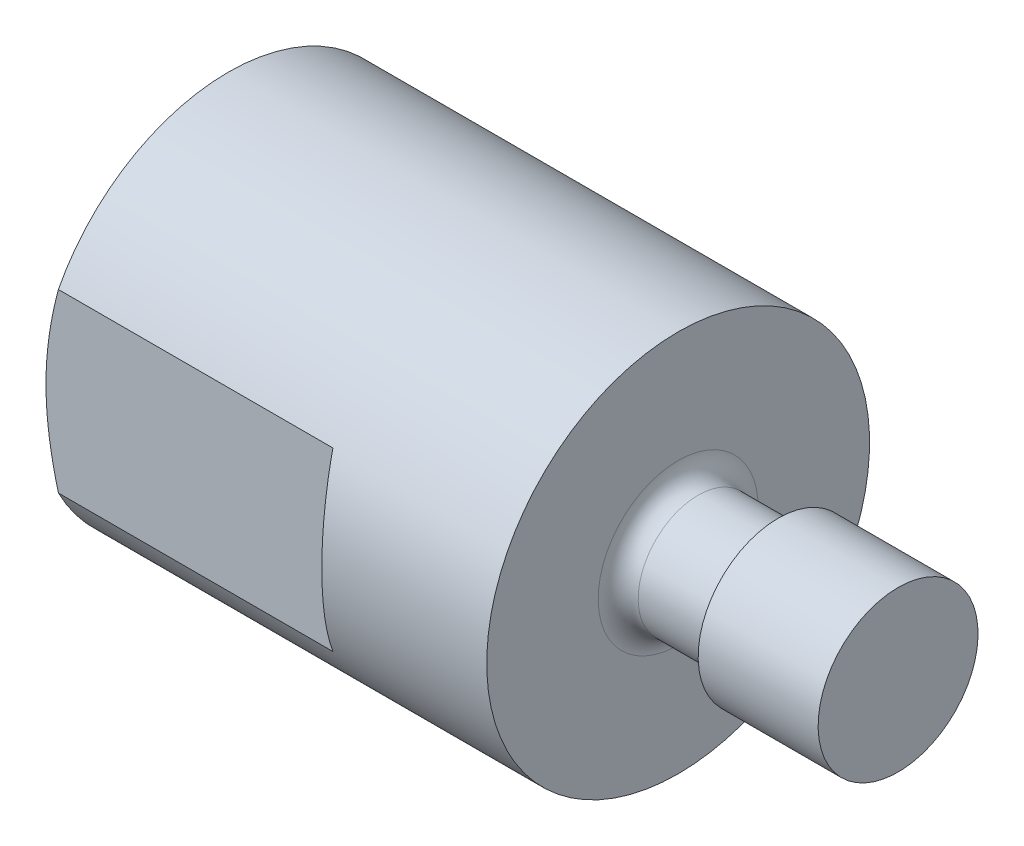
ISO-10303-21;
HEADER;
FILE_DESCRIPTION(('STEP AP214'),'2;1');
FILE_NAME('part.step','',(''),(''),'','','');
FILE_SCHEMA(('AUTOMOTIVE_DESIGN { 1 0 10303 214 1 1 1 1 }'));
ENDSEC;
DATA;
#1=APPLICATION_CONTEXT('core data for automotive mechanical design processes');
#2=APPLICATION_PROTOCOL_DEFINITION('international standard','automotive_design',2000,#1);
#3=PRODUCT_CONTEXT('',#1,'mechanical');
#4=PRODUCT('Part','Part','',(#3));
#5=PRODUCT_RELATED_PRODUCT_CATEGORY('part','',(#4));
#6=PRODUCT_DEFINITION_FORMATION('','',#4);
#7=PRODUCT_DEFINITION_CONTEXT('part definition',#1,'design');
#8=PRODUCT_DEFINITION('design','',#6,#7);
#9=PRODUCT_DEFINITION_SHAPE('','',#8);
#10=(LENGTH_UNIT() NAMED_UNIT(*) SI_UNIT(.MILLI.,.METRE.));
#11=(NAMED_UNIT(*) PLANE_ANGLE_UNIT() SI_UNIT($,.RADIAN.));
#12=(NAMED_UNIT(*) SI_UNIT($,.STERADIAN.) SOLID_ANGLE_UNIT());
#13=UNCERTAINTY_MEASURE_WITH_UNIT(LENGTH_MEASURE(1.E-05),#10,'distance_accuracy_value','');
#14=(GEOMETRIC_REPRESENTATION_CONTEXT(3) GLOBAL_UNCERTAINTY_ASSIGNED_CONTEXT((#13)) GLOBAL_UNIT_ASSIGNED_CONTEXT((#10,
#11,#12)) REPRESENTATION_CONTEXT('',''));
#15=CARTESIAN_POINT('',(0.,0.,0.));
#16=DIRECTION('',(0.,0.,1.));
#17=DIRECTION('',(1.,0.,0.));
#18=AXIS2_PLACEMENT_3D('',#15,#16,#17);
#19=CARTESIAN_POINT('',(1.,0.,0.));
#20=DIRECTION('',(1.,0.,0.));
#21=DIRECTION('',(0.,1.,0.));
#22=AXIS2_PLACEMENT_3D('',#19,#20,#21);
#23=CONICAL_SURFACE('',#22,9.575,1.0471975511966);
#24=CARTESIAN_POINT('',(0.,0.,0.));
#25=DIRECTION('',(1.,0.,0.));
#26=DIRECTION('',(0.,1.,0.));
#27=AXIS2_PLACEMENT_3D('',#24,#25,#26);
#28=CIRCLE('',#27,7.84294919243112);
#29=CARTESIAN_POINT('',(0.,7.84294919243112,0.));
#30=VERTEX_POINT('',#29);
#31=EDGE_CURVE('E143',#30,#30,#28,.T.);
#32=ORIENTED_EDGE('',*,*,#31,.T.);
#33=EDGE_LOOP('',(#32));
#34=FACE_BOUND('',#33,.T.);
#35=CARTESIAN_POINT('',(1.,0.,0.));
#36=DIRECTION('',(1.,0.,0.));
#37=DIRECTION('',(0.,1.,0.));
#38=AXIS2_PLACEMENT_3D('',#35,#36,#37);
#39=CIRCLE('',#38,9.575);
#40=CARTESIAN_POINT('',(1.,4.40801826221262,-8.5));
#41=VERTEX_POINT('',#40);
#42=CARTESIAN_POINT('',(1.00000000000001,4.40801826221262,8.5));
#43=VERTEX_POINT('',#42);
#44=EDGE_CURVE('E142',#41,#43,#39,.T.);
#45=ORIENTED_EDGE('',*,*,#44,.F.);
#46=CARTESIAN_POINT('',(4.36089259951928,-12.8372156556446,-8.5));
#47=CARTESIAN_POINT('',(4.27139653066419,-12.6512992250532,-8.5));
#48=CARTESIAN_POINT('',(4.18237819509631,-12.4651529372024,-8.5));
#49=CARTESIAN_POINT('',(4.00540707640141,-12.0923520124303,-8.5));
#50=CARTESIAN_POINT('',(3.91745430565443,-11.9056973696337,-8.5));
#51=CARTESIAN_POINT('',(3.65533262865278,-11.3448403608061,-8.5));
#52=CARTESIAN_POINT('',(3.48293111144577,-10.9698086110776,-8.5));
#53=CARTESIAN_POINT('',(3.14296570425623,-10.2148534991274,-8.5));
#54=CARTESIAN_POINT('',(2.97543689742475,-9.8349142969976,-8.5));
#55=CARTESIAN_POINT('',(2.64783348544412,-9.07184719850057,-8.5));
#56=CARTESIAN_POINT('',(2.48775847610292,-8.68871947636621,-8.5));
#57=CARTESIAN_POINT('',(2.17549814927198,-7.91475078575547,-8.5));
#58=CARTESIAN_POINT('',(2.02340850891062,-7.52387099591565,-8.5));
#59=CARTESIAN_POINT('',(1.73159150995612,-6.73743923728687,-8.5));
#60=CARTESIAN_POINT('',(1.59186554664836,-6.34188674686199,-8.5));
#61=CARTESIAN_POINT('',(1.32866203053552,-5.546349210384,-8.5));
#62=CARTESIAN_POINT('',(1.2051483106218,-5.14637626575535,-8.5));
#63=CARTESIAN_POINT('',(0.978492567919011,-4.3407706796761,-8.5));
#64=CARTESIAN_POINT('',(0.875343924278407,-3.93513992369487,-8.5));
#65=CARTESIAN_POINT('',(0.694530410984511,-3.11780575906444,-8.5));
#66=CARTESIAN_POINT('',(0.616881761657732,-2.70609865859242,-8.5));
#67=CARTESIAN_POINT('',(0.523519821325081,-2.08507081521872,-8.5));
#68=CARTESIAN_POINT('',(0.496249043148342,-1.8774574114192,-8.5));
#69=CARTESIAN_POINT('',(0.449950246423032,-1.46132002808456,-8.5));
#70=CARTESIAN_POINT('',(0.430921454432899,-1.25279613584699,-8.5));
#71=CARTESIAN_POINT('',(0.401610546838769,-0.836338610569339,-8.5));
#72=CARTESIAN_POINT('',(0.391278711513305,-0.628408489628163,-8.5));
#73=CARTESIAN_POINT('',(0.379412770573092,-0.212298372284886,-8.5));
#74=CARTESIAN_POINT('',(0.377878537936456,-0.00411837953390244,-8.5));
#75=CARTESIAN_POINT('',(0.383643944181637,0.412065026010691,-8.5));
#76=CARTESIAN_POINT('',(0.390941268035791,0.620068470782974,-8.5));
#77=CARTESIAN_POINT('',(0.414194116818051,1.03559395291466,-8.5));
#78=CARTESIAN_POINT('',(0.430150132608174,1.24311596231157,-8.5));
#79=CARTESIAN_POINT('',(0.479548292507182,1.75178817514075,-8.5));
#80=CARTESIAN_POINT('',(0.517645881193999,2.05249455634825,-8.5));
#81=CARTESIAN_POINT('',(0.609856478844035,2.65142977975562,-8.5));
#82=CARTESIAN_POINT('',(0.663972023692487,2.94965822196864,-8.5));
#83=CARTESIAN_POINT('',(0.847616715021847,3.84120788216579,-8.5));
#84=CARTESIAN_POINT('',(0.998315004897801,4.43021264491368,-8.5));
#85=CARTESIAN_POINT('',(1.2566186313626,5.3109066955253,-8.5));
#86=CARTESIAN_POINT('',(1.34929645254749,5.60723378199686,-8.5));
#87=CARTESIAN_POINT('',(1.54351203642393,6.19702583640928,-8.5));
#88=CARTESIAN_POINT('',(1.64505057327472,6.49049055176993,-8.5));
#89=CARTESIAN_POINT('',(1.85484115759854,7.07308798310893,-8.5));
#90=CARTESIAN_POINT('',(1.96305147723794,7.36223587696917,-8.5));
#91=CARTESIAN_POINT('',(2.18549130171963,7.93809953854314,-8.5));
#92=CARTESIAN_POINT('',(2.29971876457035,8.22481609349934,-8.5));
#93=CARTESIAN_POINT('',(2.41638555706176,8.51051350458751,-8.5));
#94=B_SPLINE_CURVE_WITH_KNOTS('',3,(#46,#47,#48,#49,#50,#51,#52,#53,#54,#55,#56,#57,#58,#59,#60,
#61,#62,#63,#64,#65,#66,#67,#68,#69,#70,#71,#72,#73,#74,#75,#76,#77,#78,#79,#80,#81,#82,#83,#84,
#85,#86,#87,#88,#89,#90,#91,#92,#93),.UNSPECIFIED.,.F.,.F.,(4,2,2,2,2,2,2,2,2,2,2,2,2,2,2,2,2,2,
2,2,2,2,2,4),(0.,0.619006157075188,1.238019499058,2.47625836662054,3.72189992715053,
4.96747386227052,6.22559022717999,7.48384839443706,8.73925005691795,9.9942429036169,
11.2500325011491,11.8780848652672,12.5060782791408,13.130456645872,13.7548259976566,
14.3790317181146,15.0032728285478,15.9120828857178,16.8210368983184,18.6424926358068,
19.573870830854,20.5053304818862,21.4314616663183,22.3572805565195),.UNSPECIFIED.);
#95=CARTESIAN_POINT('',(1.00000000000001,-4.40801826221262,-8.5));
#96=VERTEX_POINT('',#95);
#97=EDGE_CURVE('E83',#41,#96,#94,.F.);
#98=ORIENTED_EDGE('',*,*,#97,.T.);
#99=CARTESIAN_POINT('',(0.999999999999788,-4.40801826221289,8.5));
#100=VERTEX_POINT('',#99);
#101=EDGE_CURVE('E141',#100,#96,#39,.T.);
#102=ORIENTED_EDGE('',*,*,#101,.F.);
#103=CARTESIAN_POINT('',(4.36089259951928,-12.8372156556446,8.5));
#104=CARTESIAN_POINT('',(4.27139653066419,-12.6512992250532,8.5));
#105=CARTESIAN_POINT('',(4.18237819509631,-12.4651529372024,8.5));
#106=CARTESIAN_POINT('',(4.00540707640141,-12.0923520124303,8.5));
#107=CARTESIAN_POINT('',(3.91745430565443,-11.9056973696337,8.5));
#108=CARTESIAN_POINT('',(3.65533262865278,-11.3448403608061,8.5));
#109=CARTESIAN_POINT('',(3.48293111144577,-10.9698086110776,8.5));
#110=CARTESIAN_POINT('',(3.14296570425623,-10.2148534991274,8.5));
#111=CARTESIAN_POINT('',(2.97543689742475,-9.8349142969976,8.5));
#112=CARTESIAN_POINT('',(2.64783348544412,-9.07184719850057,8.5));
#113=CARTESIAN_POINT('',(2.48775847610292,-8.68871947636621,8.5));
#114=CARTESIAN_POINT('',(2.17549814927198,-7.91475078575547,8.5));
#115=CARTESIAN_POINT('',(2.02340850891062,-7.52387099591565,8.5));
#116=CARTESIAN_POINT('',(1.73159150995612,-6.73743923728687,8.5));
#117=CARTESIAN_POINT('',(1.59186554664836,-6.34188674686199,8.5));
#118=CARTESIAN_POINT('',(1.32866203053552,-5.546349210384,8.5));
#119=CARTESIAN_POINT('',(1.2051483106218,-5.14637626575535,8.5));
#120=CARTESIAN_POINT('',(0.978492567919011,-4.3407706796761,8.5));
#121=CARTESIAN_POINT('',(0.875343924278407,-3.93513992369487,8.5));
#122=CARTESIAN_POINT('',(0.694530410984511,-3.11780575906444,8.5));
#123=CARTESIAN_POINT('',(0.616881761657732,-2.70609865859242,8.5));
#124=CARTESIAN_POINT('',(0.523519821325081,-2.08507081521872,8.5));
#125=CARTESIAN_POINT('',(0.496249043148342,-1.8774574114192,8.5));
#126=CARTESIAN_POINT('',(0.449950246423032,-1.46132002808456,8.5));
#127=CARTESIAN_POINT('',(0.430921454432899,-1.25279613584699,8.5));
#128=CARTESIAN_POINT('',(0.401610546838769,-0.836338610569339,8.5));
#129=CARTESIAN_POINT('',(0.391278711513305,-0.628408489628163,8.5));
#130=CARTESIAN_POINT('',(0.379412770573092,-0.212298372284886,8.5));
#131=CARTESIAN_POINT('',(0.377878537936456,-0.00411837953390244,8.5));
#132=CARTESIAN_POINT('',(0.383643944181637,0.412065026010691,8.5));
#133=CARTESIAN_POINT('',(0.390941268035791,0.620068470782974,8.5));
#134=CARTESIAN_POINT('',(0.414194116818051,1.03559395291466,8.5));
#135=CARTESIAN_POINT('',(0.430150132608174,1.24311596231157,8.5));
#136=CARTESIAN_POINT('',(0.479548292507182,1.75178817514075,8.5));
#137=CARTESIAN_POINT('',(0.517645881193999,2.05249455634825,8.5));
#138=CARTESIAN_POINT('',(0.609856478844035,2.65142977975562,8.5));
#139=CARTESIAN_POINT('',(0.663972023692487,2.94965822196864,8.5));
#140=CARTESIAN_POINT('',(0.847616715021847,3.84120788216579,8.5));
#141=CARTESIAN_POINT('',(0.998315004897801,4.43021264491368,8.5));
#142=CARTESIAN_POINT('',(1.2566186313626,5.3109066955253,8.5));
#143=CARTESIAN_POINT('',(1.34929645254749,5.60723378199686,8.5));
#144=CARTESIAN_POINT('',(1.54351203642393,6.19702583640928,8.5));
#145=CARTESIAN_POINT('',(1.64505057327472,6.49049055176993,8.5));
#146=CARTESIAN_POINT('',(1.85484115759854,7.07308798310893,8.5));
#147=CARTESIAN_POINT('',(1.96305147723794,7.36223587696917,8.5));
#148=CARTESIAN_POINT('',(2.18549130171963,7.93809953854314,8.5));
#149=CARTESIAN_POINT('',(2.29971876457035,8.22481609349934,8.5));
#150=CARTESIAN_POINT('',(2.41638555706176,8.51051350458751,8.5));
#151=B_SPLINE_CURVE_WITH_KNOTS('',3,(#103,#104,#105,#106,#107,#108,#109,#110,#111,#112,#113,
#114,#115,#116,#117,#118,#119,#120,#121,#122,#123,#124,#125,#126,#127,#128,#129,#130,#131,#132,
#133,#134,#135,#136,#137,#138,#139,#140,#141,#142,#143,#144,#145,#146,#147,#148,#149,#150),
.UNSPECIFIED.,.F.,.F.,(4,2,2,2,2,2,2,2,2,2,2,2,2,2,2,2,2,2,2,2,2,2,2,4),(0.,0.619006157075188,
1.238019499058,2.47625836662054,3.72189992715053,4.96747386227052,6.22559022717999,
7.48384839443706,8.73925005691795,9.9942429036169,11.2500325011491,11.8780848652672,
12.5060782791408,13.130456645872,13.7548259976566,14.3790317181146,15.0032728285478,
15.9120828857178,16.8210368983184,18.6424926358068,19.573870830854,20.5053304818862,
21.4314616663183,22.3572805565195),.UNSPECIFIED.);
#152=EDGE_CURVE('E120',#100,#43,#151,.T.);
#153=ORIENTED_EDGE('',*,*,#152,.T.);
#154=EDGE_LOOP('',(#45,#98,#102,#153));
#155=FACE_BOUND('',#154,.T.);
#156=ADVANCED_FACE('F32',(#34,#155),#23,.T.);
#157=CARTESIAN_POINT('',(34.5,0.,0.));
#158=DIRECTION('',(1.,0.,0.));
#159=DIRECTION('',(0.,1.,0.));
#160=AXIS2_PLACEMENT_3D('',#157,#158,#159);
#161=CYLINDRICAL_SURFACE('',#160,9.575);
#162=CARTESIAN_POINT('',(23.5,0.,0.));
#163=DIRECTION('',(1.,0.,0.));
#164=DIRECTION('',(0.,1.,0.));
#165=AXIS2_PLACEMENT_3D('',#162,#163,#164);
#166=CIRCLE('',#165,9.575);
#167=CARTESIAN_POINT('',(23.5,9.575,0.));
#168=VERTEX_POINT('',#167);
#169=EDGE_CURVE('E148',#168,#168,#166,.T.);
#170=ORIENTED_EDGE('',*,*,#169,.F.);
#171=EDGE_LOOP('',(#170));
#172=FACE_BOUND('',#171,.T.);
#173=DIRECTION('',(1.,0.,0.));
#174=VECTOR('',#173,1.);
#175=CARTESIAN_POINT('',(34.5,-4.40801826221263,-8.5));
#176=LINE('',#175,#174);
#177=CARTESIAN_POINT('',(14.7315955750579,-4.40801826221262,-8.5));
#178=VERTEX_POINT('',#177);
#179=EDGE_CURVE('E86',#96,#178,#176,.T.);
#180=ORIENTED_EDGE('',*,*,#179,.T.);
#181=CARTESIAN_POINT('',(14.7315955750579,-4.40801826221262,-8.5));
#182=CARTESIAN_POINT('',(14.7832750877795,-4.19145809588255,-8.61233061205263));
#183=CARTESIAN_POINT('',(14.8320446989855,-3.96999974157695,-8.71664956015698));
#184=CARTESIAN_POINT('',(14.922790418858,-3.51847541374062,-8.90848135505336));
#185=CARTESIAN_POINT('',(14.9647638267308,-3.28840606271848,-8.99598752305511));
#186=CARTESIAN_POINT('',(15.0409132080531,-2.8209466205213,-9.15334606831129));
#187=CARTESIAN_POINT('',(15.0750866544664,-2.58355418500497,-9.22319272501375));
#188=CARTESIAN_POINT('',(15.1347993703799,-2.10307530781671,-9.34446743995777));
#189=CARTESIAN_POINT('',(15.1603399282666,-1.85998972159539,-9.39589824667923));
#190=CARTESIAN_POINT('',(15.2022140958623,-1.36909733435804,-9.47989305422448));
#191=CARTESIAN_POINT('',(15.218522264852,-1.12127941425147,-9.51240492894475));
#192=CARTESIAN_POINT('',(15.241404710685,-0.623410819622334,-9.55795311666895));
#193=CARTESIAN_POINT('',(15.2479790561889,-0.373360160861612,-9.57098956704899));
#194=CARTESIAN_POINT('',(15.2512218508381,0.126924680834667,-9.57742471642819));
#195=CARTESIAN_POINT('',(15.2478955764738,0.377158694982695,-9.57083387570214));
#196=CARTESIAN_POINT('',(15.2314354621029,0.876002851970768,-9.53811916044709));
#197=CARTESIAN_POINT('',(15.2183023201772,1.12461310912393,-9.51199667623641));
#198=CARTESIAN_POINT('',(15.1831864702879,1.60983733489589,-9.44177218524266));
#199=CARTESIAN_POINT('',(15.161524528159,1.84656936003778,-9.39832120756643));
#200=CARTESIAN_POINT('',(15.1098856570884,2.31522984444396,-9.29397472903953));
#201=CARTESIAN_POINT('',(15.0799086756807,2.54715827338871,-9.23307911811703));
#202=CARTESIAN_POINT('',(15.0123653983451,3.00450183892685,-9.09453856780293));
#203=CARTESIAN_POINT('',(14.9748079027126,3.22992418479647,-9.01691304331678));
#204=CARTESIAN_POINT('',(14.8929165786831,3.67320315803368,-8.84559889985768));
#205=CARTESIAN_POINT('',(14.8485862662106,3.89106363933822,-8.75191861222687));
#206=CARTESIAN_POINT('',(14.7900410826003,4.15567359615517,-8.62636687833));
#207=CARTESIAN_POINT('',(14.7785681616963,4.20652601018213,-8.60168341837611));
#208=CARTESIAN_POINT('',(14.7553131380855,4.30767600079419,-8.55147559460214));
#209=CARTESIAN_POINT('',(14.7435313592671,4.35797408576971,-8.5259521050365));
#210=CARTESIAN_POINT('',(14.7315955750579,4.40801826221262,-8.5));
#211=B_SPLINE_CURVE_WITH_KNOTS('',3,(#181,#182,#183,#184,#185,#186,#187,#188,#189,#190,#191,
#192,#193,#194,#195,#196,#197,#198,#199,#200,#201,#202,#203,#204,#205,#206,#207,#208,#209,#210),
.UNSPECIFIED.,.F.,.F.,(4,2,2,2,2,2,2,2,2,2,2,2,2,2,4),(0.,0.747992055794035,1.49628063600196,
2.24481130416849,2.99323021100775,3.74370154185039,4.49416757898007,5.24423373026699,
5.99424649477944,6.71839734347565,7.44255276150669,8.16587228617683,8.88881758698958,
9.06184960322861,9.23470690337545),.UNSPECIFIED.);
#212=CARTESIAN_POINT('',(14.7315955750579,4.40801826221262,-8.5));
#213=VERTEX_POINT('',#212);
#214=EDGE_CURVE('E46',#178,#213,#211,.T.);
#215=ORIENTED_EDGE('',*,*,#214,.T.);
#216=DIRECTION('',(1.,0.,0.));
#217=VECTOR('',#216,1.);
#218=CARTESIAN_POINT('',(34.5,4.40801826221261,-8.5));
#219=LINE('',#218,#217);
#220=EDGE_CURVE('E78',#213,#41,#219,.F.);
#221=ORIENTED_EDGE('',*,*,#220,.T.);
#222=ORIENTED_EDGE('',*,*,#44,.T.);
#223=DIRECTION('',(1.,0.,0.));
#224=VECTOR('',#223,1.);
#225=CARTESIAN_POINT('',(34.5,4.40801826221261,8.5));
#226=LINE('',#225,#224);
#227=CARTESIAN_POINT('',(14.7315955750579,4.40801826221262,8.5));
#228=VERTEX_POINT('',#227);
#229=EDGE_CURVE('E95',#43,#228,#226,.T.);
#230=ORIENTED_EDGE('',*,*,#229,.T.);
#231=CARTESIAN_POINT('',(14.7315955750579,-4.40801826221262,8.5));
#232=CARTESIAN_POINT('',(14.7835382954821,-4.1903568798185,8.61290214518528));
#233=CARTESIAN_POINT('',(14.8325410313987,-3.96774677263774,8.71771078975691));
#234=CARTESIAN_POINT('',(14.923696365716,-3.51374870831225,8.91038398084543));
#235=CARTESIAN_POINT('',(14.9658435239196,-3.28235395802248,8.99823508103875));
#236=CARTESIAN_POINT('',(15.0420957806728,-2.81309429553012,9.15577305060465));
#237=CARTESIAN_POINT('',(15.0762290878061,-2.57525546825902,9.22552372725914));
#238=CARTESIAN_POINT('',(15.13581326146,-2.09399092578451,9.3465154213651));
#239=CARTESIAN_POINT('',(15.1612690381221,-1.85056845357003,9.39776690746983));
#240=CARTESIAN_POINT('',(15.2044883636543,-1.34079050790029,9.48444939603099));
#241=CARTESIAN_POINT('',(15.2215096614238,-1.07411122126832,9.5183603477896));
#242=CARTESIAN_POINT('',(15.2442667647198,-0.538284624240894,9.56363848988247));
#243=CARTESIAN_POINT('',(15.2499993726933,-0.269136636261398,9.57499929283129));
#244=CARTESIAN_POINT('',(15.2500005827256,0.250009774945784,9.57500065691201));
#245=CARTESIAN_POINT('',(15.2450549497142,0.500009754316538,9.56519850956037));
#246=CARTESIAN_POINT('',(15.225398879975,0.99820117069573,9.52610485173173));
#247=CARTESIAN_POINT('',(15.2106843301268,1.24639180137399,9.49680513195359));
#248=CARTESIAN_POINT('',(15.1718360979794,1.7393486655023,9.41900449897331));
#249=CARTESIAN_POINT('',(15.1476891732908,1.98410958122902,9.3704765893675));
#250=CARTESIAN_POINT('',(15.0905995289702,2.46803212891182,9.2548001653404));
#251=CARTESIAN_POINT('',(15.0576600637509,2.70719579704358,9.18765854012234));
#252=CARTESIAN_POINT('',(14.9809000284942,3.19677188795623,9.02953196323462));
#253=CARTESIAN_POINT('',(14.9364330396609,3.44661523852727,8.93710015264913));
#254=CARTESIAN_POINT('',(14.8396182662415,3.93552516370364,8.73283201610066));
#255=CARTESIAN_POINT('',(14.7873007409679,4.17462872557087,8.62106995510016));
#256=CARTESIAN_POINT('',(14.7315955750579,4.40801826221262,8.5));
#257=B_SPLINE_CURVE_WITH_KNOTS('',3,(#231,#232,#233,#234,#235,#236,#237,#238,#239,#240,#241,
#242,#243,#244,#245,#246,#247,#248,#249,#250,#251,#252,#253,#254,#255,#256),.UNSPECIFIED.,.F.,
.F.,(4,2,2,2,2,2,2,2,2,2,2,2,4),(0.,0.75179519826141,1.50418409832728,2.25388351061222,
3.00315800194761,3.81006353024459,4.61719758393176,5.36697065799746,6.11705961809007,
6.86820545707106,7.61907365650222,8.42826113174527,9.23440617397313),.UNSPECIFIED.);
#258=CARTESIAN_POINT('',(14.7315955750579,-4.40801826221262,8.5));
#259=VERTEX_POINT('',#258);
#260=EDGE_CURVE('E157',#259,#228,#257,.T.);
#261=ORIENTED_EDGE('',*,*,#260,.F.);
#262=DIRECTION('',(1.,0.,0.));
#263=VECTOR('',#262,1.);
#264=CARTESIAN_POINT('',(34.5,-4.40801826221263,8.5));
#265=LINE('',#264,#263);
#266=EDGE_CURVE('E92',#259,#100,#265,.F.);
#267=ORIENTED_EDGE('',*,*,#266,.T.);
#268=ORIENTED_EDGE('',*,*,#101,.T.);
#269=EDGE_LOOP('',(#180,#215,#221,#222,#230,#261,#267,#268));
#270=FACE_BOUND('',#269,.T.);
#271=ADVANCED_FACE('F90',(#172,#270),#161,.T.);
#272=CARTESIAN_POINT('',(0.,0.,0.));
#273=DIRECTION('',(-1.,0.,0.));
#274=DIRECTION('',(0.,-1.,0.));
#275=AXIS2_PLACEMENT_3D('',#272,#273,#274);
#276=PLANE('',#275);
#277=CARTESIAN_POINT('',(0.,0.,0.));
#278=DIRECTION('',(-1.,0.,0.));
#279=DIRECTION('',(0.,-1.,0.));
#280=AXIS2_PLACEMENT_3D('',#277,#278,#279);
#281=CIRCLE('',#280,5.49999999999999);
#282=CARTESIAN_POINT('',(0.,-5.49999999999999,0.));
#283=VERTEX_POINT('',#282);
#284=EDGE_CURVE('E11',#283,#283,#281,.F.);
#285=ORIENTED_EDGE('',*,*,#284,.T.);
#286=EDGE_LOOP('',(#285));
#287=FACE_BOUND('',#286,.T.);
#288=ORIENTED_EDGE('',*,*,#31,.F.);
#289=EDGE_LOOP('',(#288));
#290=FACE_BOUND('',#289,.T.);
#291=ADVANCED_FACE('F134',(#287,#290),#276,.T.);
#292=CARTESIAN_POINT('',(23.5,9.575,0.));
#293=DIRECTION('',(1.,0.,0.));
#294=DIRECTION('',(0.,1.,0.));
#295=AXIS2_PLACEMENT_3D('',#292,#293,#294);
#296=PLANE('',#295);
#297=CARTESIAN_POINT('',(23.5,0.,0.));
#298=DIRECTION('',(1.,0.,0.));
#299=DIRECTION('',(0.,1.,0.));
#300=AXIS2_PLACEMENT_3D('',#297,#298,#299);
#301=CIRCLE('',#300,4.);
#302=CARTESIAN_POINT('',(23.5,4.,0.));
#303=VERTEX_POINT('',#302);
#304=EDGE_CURVE('E154',#303,#303,#301,.F.);
#305=ORIENTED_EDGE('',*,*,#304,.T.);
#306=EDGE_LOOP('',(#305));
#307=FACE_BOUND('',#306,.T.);
#308=ORIENTED_EDGE('',*,*,#169,.T.);
#309=EDGE_LOOP('',(#308));
#310=FACE_BOUND('',#309,.T.);
#311=ADVANCED_FACE('F193',(#307,#310),#296,.T.);
#312=CARTESIAN_POINT('',(34.5,0.,0.));
#313=DIRECTION('',(1.,0.,0.));
#314=DIRECTION('',(0.,1.,0.));
#315=AXIS2_PLACEMENT_3D('',#312,#313,#314);
#316=CYLINDRICAL_SURFACE('',#315,3.);
#317=CARTESIAN_POINT('',(24.5,0.,0.));
#318=DIRECTION('',(1.,0.,0.));
#319=DIRECTION('',(0.,1.,0.));
#320=AXIS2_PLACEMENT_3D('',#317,#318,#319);
#321=CIRCLE('',#320,3.);
#322=CARTESIAN_POINT('',(24.5,3.,0.));
#323=VERTEX_POINT('',#322);
#324=EDGE_CURVE('E146',#323,#323,#321,.T.);
#325=ORIENTED_EDGE('',*,*,#324,.T.);
#326=EDGE_LOOP('',(#325));
#327=FACE_BOUND('',#326,.T.);
#328=CARTESIAN_POINT('',(28.5,0.,0.));
#329=DIRECTION('',(1.,0.,0.));
#330=DIRECTION('',(0.,1.,0.));
#331=AXIS2_PLACEMENT_3D('',#328,#329,#330);
#332=CIRCLE('',#331,3.);
#333=CARTESIAN_POINT('',(28.5,3.,0.));
#334=VERTEX_POINT('',#333);
#335=EDGE_CURVE('E206',#334,#334,#332,.T.);
#336=ORIENTED_EDGE('',*,*,#335,.F.);
#337=EDGE_LOOP('',(#336));
#338=FACE_BOUND('',#337,.T.);
#339=ADVANCED_FACE('F190',(#327,#338),#316,.T.);
#340=CARTESIAN_POINT('',(28.5,3.,0.));
#341=DIRECTION('',(-1.,0.,0.));
#342=DIRECTION('',(0.,-1.,0.));
#343=AXIS2_PLACEMENT_3D('',#340,#341,#342);
#344=PLANE('',#343);
#345=ORIENTED_EDGE('',*,*,#335,.T.);
#346=EDGE_LOOP('',(#345));
#347=FACE_BOUND('',#346,.T.);
#348=CARTESIAN_POINT('',(28.5,0.,0.));
#349=DIRECTION('',(1.,0.,0.));
#350=DIRECTION('',(0.,1.,0.));
#351=AXIS2_PLACEMENT_3D('',#348,#349,#350);
#352=CIRCLE('',#351,4.00000000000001);
#353=CARTESIAN_POINT('',(28.5,4.,0.));
#354=VERTEX_POINT('',#353);
#355=EDGE_CURVE('E208',#354,#354,#352,.T.);
#356=ORIENTED_EDGE('',*,*,#355,.F.);
#357=EDGE_LOOP('',(#356));
#358=FACE_BOUND('',#357,.T.);
#359=ADVANCED_FACE('F186',(#347,#358),#344,.T.);
#360=CARTESIAN_POINT('',(34.5,0.,0.));
#361=DIRECTION('',(1.,0.,0.));
#362=DIRECTION('',(0.,1.,0.));
#363=AXIS2_PLACEMENT_3D('',#360,#361,#362);
#364=CYLINDRICAL_SURFACE('',#363,4.00000000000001);
#365=ORIENTED_EDGE('',*,*,#355,.T.);
#366=EDGE_LOOP('',(#365));
#367=FACE_BOUND('',#366,.T.);
#368=CARTESIAN_POINT('',(34.5,0.,0.));
#369=DIRECTION('',(1.,0.,0.));
#370=DIRECTION('',(0.,1.,0.));
#371=AXIS2_PLACEMENT_3D('',#368,#369,#370);
#372=CIRCLE('',#371,4.00000000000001);
#373=CARTESIAN_POINT('',(34.5,4.,0.));
#374=VERTEX_POINT('',#373);
#375=EDGE_CURVE('E211',#374,#374,#372,.T.);
#376=ORIENTED_EDGE('',*,*,#375,.F.);
#377=EDGE_LOOP('',(#376));
#378=FACE_BOUND('',#377,.T.);
#379=ADVANCED_FACE('F182',(#367,#378),#364,.T.);
#380=CARTESIAN_POINT('',(34.5,4.,0.));
#381=DIRECTION('',(1.,0.,0.));
#382=DIRECTION('',(0.,1.,0.));
#383=AXIS2_PLACEMENT_3D('',#380,#381,#382);
#384=PLANE('',#383);
#385=ORIENTED_EDGE('',*,*,#375,.T.);
#386=EDGE_LOOP('',(#385));
#387=FACE_BOUND('',#386,.T.);
#388=ADVANCED_FACE('F179',(#387),#384,.T.);
#389=CARTESIAN_POINT('',(24.5,0.,0.));
#390=DIRECTION('',(1.,0.,0.));
#391=DIRECTION('',(0.,1.,0.));
#392=AXIS2_PLACEMENT_3D('',#389,#390,#391);
#393=TOROIDAL_SURFACE('',#392,4.,1.);
#394=ORIENTED_EDGE('',*,*,#304,.F.);
#395=EDGE_LOOP('',(#394));
#396=FACE_BOUND('',#395,.T.);
#397=ORIENTED_EDGE('',*,*,#324,.F.);
#398=EDGE_LOOP('',(#397));
#399=FACE_BOUND('',#398,.T.);
#400=ADVANCED_FACE('F173',(#396,#399),#393,.F.);
#401=CARTESIAN_POINT('',(17.,0.,0.));
#402=DIRECTION('',(-1.,0.,0.));
#403=DIRECTION('',(0.,0.,1.));
#404=AXIS2_PLACEMENT_3D('',#401,#402,#403);
#405=CONICAL_SURFACE('',#404,4.5,1.02974425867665);
#406=CARTESIAN_POINT('',(19.703872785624,0.,0.));
#407=VERTEX_POINT('',#406);
#408=VERTEX_LOOP('',#407);
#409=FACE_BOUND('',#408,.T.);
#410=CARTESIAN_POINT('',(17.,0.,0.));
#411=DIRECTION('',(-1.,0.,0.));
#412=DIRECTION('',(0.,0.,1.));
#413=AXIS2_PLACEMENT_3D('',#410,#411,#412);
#414=CIRCLE('',#413,4.5);
#415=CARTESIAN_POINT('',(17.,0.,4.5));
#416=VERTEX_POINT('',#415);
#417=EDGE_CURVE('E127',#416,#416,#414,.T.);
#418=ORIENTED_EDGE('',*,*,#417,.T.);
#419=EDGE_LOOP('',(#418));
#420=FACE_BOUND('',#419,.T.);
#421=ADVANCED_FACE('F168',(#409,#420),#405,.F.);
#422=CARTESIAN_POINT('',(0.,0.,0.));
#423=DIRECTION('',(-1.,0.,0.));
#424=DIRECTION('',(0.,0.,1.));
#425=AXIS2_PLACEMENT_3D('',#422,#423,#424);
#426=CYLINDRICAL_SURFACE('',#425,4.5);
#427=CARTESIAN_POINT('',(0.999999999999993,0.,0.));
#428=DIRECTION('',(-1.,0.,0.));
#429=DIRECTION('',(0.,0.,1.));
#430=AXIS2_PLACEMENT_3D('',#427,#428,#429);
#431=CIRCLE('',#430,4.5);
#432=CARTESIAN_POINT('',(0.999999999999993,0.,4.5));
#433=VERTEX_POINT('',#432);
#434=EDGE_CURVE('E40',#433,#433,#431,.T.);
#435=ORIENTED_EDGE('',*,*,#434,.T.);
#436=EDGE_LOOP('',(#435));
#437=FACE_BOUND('',#436,.T.);
#438=ORIENTED_EDGE('',*,*,#417,.F.);
#439=EDGE_LOOP('',(#438));
#440=FACE_BOUND('',#439,.T.);
#441=ADVANCED_FACE('F164',(#437,#440),#426,.F.);
#442=CARTESIAN_POINT('',(-3.75,0.,8.5));
#443=DIRECTION('',(0.,0.,1.));
#444=DIRECTION('',(1.,0.,0.));
#445=AXIS2_PLACEMENT_3D('',#442,#443,#444);
#446=CYLINDRICAL_SURFACE('',#445,19.);
#447=CARTESIAN_POINT('',(-3.75,0.,8.5));
#448=DIRECTION('',(0.,0.,1.));
#449=DIRECTION('',(1.,0.,0.));
#450=AXIS2_PLACEMENT_3D('',#447,#448,#449);
#451=CIRCLE('',#450,19.);
#452=EDGE_CURVE('E54',#259,#228,#451,.T.);
#453=ORIENTED_EDGE('',*,*,#452,.F.);
#454=ORIENTED_EDGE('',*,*,#260,.T.);
#455=EDGE_LOOP('',(#453,#454));
#456=FACE_BOUND('',#455,.T.);
#457=ADVANCED_FACE('F116',(#456),#446,.F.);
#458=CARTESIAN_POINT('',(-3.75,0.,8.5));
#459=DIRECTION('',(0.,0.,1.));
#460=DIRECTION('',(1.,0.,0.));
#461=AXIS2_PLACEMENT_3D('',#458,#459,#460);
#462=PLANE('',#461);
#463=ORIENTED_EDGE('',*,*,#452,.T.);
#464=ORIENTED_EDGE('',*,*,#229,.F.);
#465=ORIENTED_EDGE('',*,*,#152,.F.);
#466=ORIENTED_EDGE('',*,*,#266,.F.);
#467=EDGE_LOOP('',(#463,#464,#465,#466));
#468=FACE_BOUND('',#467,.T.);
#469=ADVANCED_FACE('F111',(#468),#462,.T.);
#470=CARTESIAN_POINT('',(-3.75,0.,-8.5));
#471=DIRECTION('',(0.,0.,-1.));
#472=DIRECTION('',(-1.,0.,0.));
#473=AXIS2_PLACEMENT_3D('',#470,#471,#472);
#474=CYLINDRICAL_SURFACE('',#473,19.);
#475=CARTESIAN_POINT('',(-3.75,0.,-8.5));
#476=DIRECTION('',(0.,0.,1.));
#477=DIRECTION('',(1.,0.,0.));
#478=AXIS2_PLACEMENT_3D('',#475,#476,#477);
#479=CIRCLE('',#478,19.);
#480=EDGE_CURVE('E80',#178,#213,#479,.T.);
#481=ORIENTED_EDGE('',*,*,#480,.T.);
#482=ORIENTED_EDGE('',*,*,#214,.F.);
#483=EDGE_LOOP('',(#481,#482));
#484=FACE_BOUND('',#483,.T.);
#485=ADVANCED_FACE('F88',(#484),#474,.F.);
#486=CARTESIAN_POINT('',(-3.75,0.,-8.5));
#487=DIRECTION('',(0.,0.,-1.));
#488=DIRECTION('',(1.,0.,0.));
#489=AXIS2_PLACEMENT_3D('',#486,#487,#488);
#490=PLANE('',#489);
#491=ORIENTED_EDGE('',*,*,#480,.F.);
#492=ORIENTED_EDGE('',*,*,#179,.F.);
#493=ORIENTED_EDGE('',*,*,#97,.F.);
#494=ORIENTED_EDGE('',*,*,#220,.F.);
#495=EDGE_LOOP('',(#491,#492,#493,#494));
#496=FACE_BOUND('',#495,.T.);
#497=ADVANCED_FACE('F79',(#496),#490,.T.);
#498=CARTESIAN_POINT('',(0.999999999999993,0.,0.));
#499=DIRECTION('',(-1.,0.,0.));
#500=DIRECTION('',(0.,0.,1.));
#501=AXIS2_PLACEMENT_3D('',#498,#499,#500);
#502=CONICAL_SURFACE('',#501,4.5,0.78539816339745);
#503=ORIENTED_EDGE('',*,*,#284,.F.);
#504=EDGE_LOOP('',(#503));
#505=FACE_BOUND('',#504,.T.);
#506=ORIENTED_EDGE('',*,*,#434,.F.);
#507=EDGE_LOOP('',(#506));
#508=FACE_BOUND('',#507,.T.);
#509=ADVANCED_FACE('F34',(#505,#508),#502,.F.);
#510=CLOSED_SHELL('',(#156,#271,#291,#311,#339,#359,#379,#388,#400,#421,#441,#457,#469,#485,
#497,#509));
#511=MANIFOLD_SOLID_BREP('B2',#510);
#512=ADVANCED_BREP_SHAPE_REPRESENTATION('',(#18,#511),#14);
#513=SHAPE_DEFINITION_REPRESENTATION(#9,#512);
ENDSEC;
END-ISO-10303-21;
